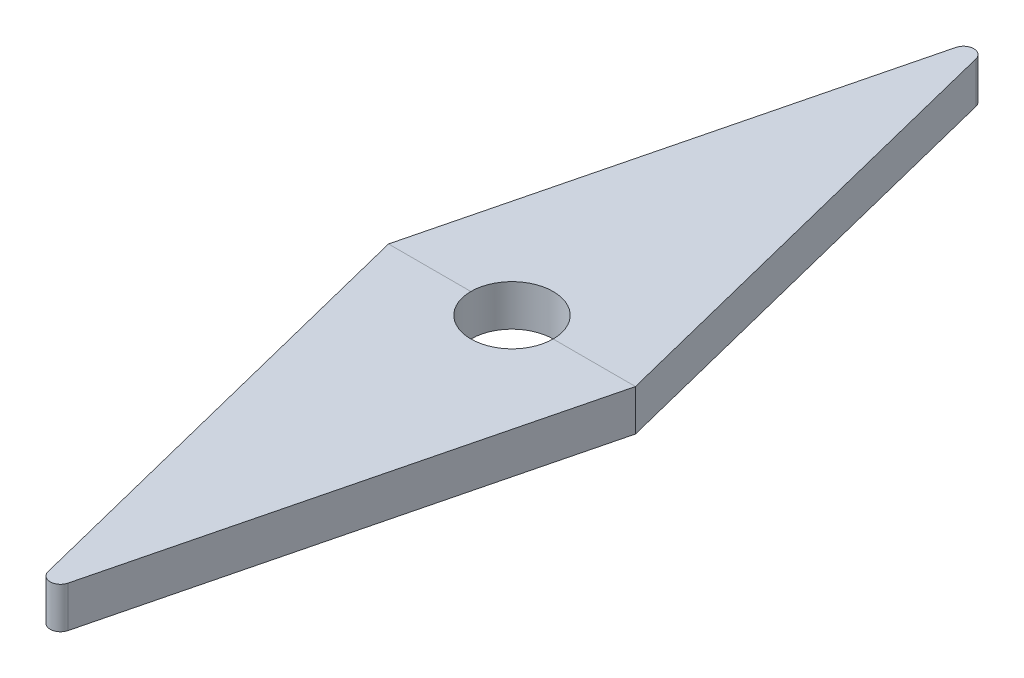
ISO-10303-21;
HEADER;
FILE_DESCRIPTION(('STEP AP214'),'2;1');
FILE_NAME('part.step','',(''),(''),'','','');
FILE_SCHEMA(('AUTOMOTIVE_DESIGN { 1 0 10303 214 1 1 1 1 }'));
ENDSEC;
DATA;
#1=APPLICATION_CONTEXT('core data for automotive mechanical design processes');
#2=APPLICATION_PROTOCOL_DEFINITION('international standard','automotive_design',2000,#1);
#3=PRODUCT_CONTEXT('',#1,'mechanical');
#4=PRODUCT('Part','Part','',(#3));
#5=PRODUCT_RELATED_PRODUCT_CATEGORY('part','',(#4));
#6=PRODUCT_DEFINITION_FORMATION('','',#4);
#7=PRODUCT_DEFINITION_CONTEXT('part definition',#1,'design');
#8=PRODUCT_DEFINITION('design','',#6,#7);
#9=PRODUCT_DEFINITION_SHAPE('','',#8);
#10=(LENGTH_UNIT() NAMED_UNIT(*) SI_UNIT(.MILLI.,.METRE.));
#11=(NAMED_UNIT(*) PLANE_ANGLE_UNIT() SI_UNIT($,.RADIAN.));
#12=(NAMED_UNIT(*) SI_UNIT($,.STERADIAN.) SOLID_ANGLE_UNIT());
#13=UNCERTAINTY_MEASURE_WITH_UNIT(LENGTH_MEASURE(1.E-05),#10,'distance_accuracy_value','');
#14=(GEOMETRIC_REPRESENTATION_CONTEXT(3) GLOBAL_UNCERTAINTY_ASSIGNED_CONTEXT((#13)) GLOBAL_UNIT_ASSIGNED_CONTEXT((#10,
#11,#12)) REPRESENTATION_CONTEXT('',''));
#15=CARTESIAN_POINT('',(0.,0.,0.));
#16=DIRECTION('',(0.,0.,1.));
#17=DIRECTION('',(1.,0.,0.));
#18=AXIS2_PLACEMENT_3D('',#15,#16,#17);
#19=CARTESIAN_POINT('',(0.,6.,0.));
#20=DIRECTION('',(0.,1.,0.));
#21=DIRECTION('',(0.,0.,1.));
#22=AXIS2_PLACEMENT_3D('',#19,#20,#21);
#23=PLANE('',#22);
#24=DIRECTION('',(0.242535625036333,0.,-0.970142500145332));
#25=VECTOR('',#24,1.);
#26=CARTESIAN_POINT('',(0.,6.,24.));
#27=LINE('',#26,#25);
#28=CARTESIAN_POINT('',(0.485071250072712,6.,22.0597149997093));
#29=VERTEX_POINT('',#28);
#30=CARTESIAN_POINT('',(6.00000000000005,6.,0.));
#31=VERTEX_POINT('',#30);
#32=EDGE_CURVE('E125',#29,#31,#27,.T.);
#33=ORIENTED_EDGE('',*,*,#32,.T.);
#34=DIRECTION('',(-1.,0.,0.));
#35=VECTOR('',#34,1.);
#36=CARTESIAN_POINT('',(0.,6.,0.));
#37=LINE('',#36,#35);
#38=CARTESIAN_POINT('',(2.,6.,0.));
#39=VERTEX_POINT('',#38);
#40=EDGE_CURVE('E11',#31,#39,#37,.T.);
#41=ORIENTED_EDGE('',*,*,#40,.T.);
#42=CARTESIAN_POINT('',(0.,6.,0.));
#43=DIRECTION('',(0.,1.,0.));
#44=DIRECTION('',(0.,0.,1.));
#45=AXIS2_PLACEMENT_3D('',#42,#43,#44);
#46=CIRCLE('',#45,2.);
#47=CARTESIAN_POINT('',(-2.,6.,0.));
#48=VERTEX_POINT('',#47);
#49=EDGE_CURVE('E96',#48,#39,#46,.T.);
#50=ORIENTED_EDGE('',*,*,#49,.F.);
#51=CARTESIAN_POINT('',(-5.99999999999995,6.,0.));
#52=VERTEX_POINT('',#51);
#53=EDGE_CURVE('E41',#48,#52,#37,.T.);
#54=ORIENTED_EDGE('',*,*,#53,.T.);
#55=DIRECTION('',(0.242535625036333,0.,0.970142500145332));
#56=VECTOR('',#55,1.);
#57=CARTESIAN_POINT('',(-5.99999999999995,6.,0.));
#58=LINE('',#57,#56);
#59=CARTESIAN_POINT('',(-0.485071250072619,6.,22.0597149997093));
#60=VERTEX_POINT('',#59);
#61=EDGE_CURVE('E94',#52,#60,#58,.T.);
#62=ORIENTED_EDGE('',*,*,#61,.T.);
#63=CARTESIAN_POINT('',(0.,6.,21.9384471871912));
#64=DIRECTION('',(0.,1.,0.));
#65=DIRECTION('',(0.,0.,1.));
#66=AXIS2_PLACEMENT_3D('',#63,#64,#65);
#67=CIRCLE('',#66,0.5);
#68=EDGE_CURVE('E148',#60,#29,#67,.T.);
#69=ORIENTED_EDGE('',*,*,#68,.T.);
#70=EDGE_LOOP('',(#33,#41,#50,#54,#62,#69));
#71=FACE_BOUND('',#70,.T.);
#72=ADVANCED_FACE('F37',(#71),#23,.T.);
#73=ORIENTED_EDGE('',*,*,#40,.F.);
#74=DIRECTION('',(-0.242535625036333,0.,-0.970142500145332));
#75=VECTOR('',#74,1.);
#76=CARTESIAN_POINT('',(6.00000000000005,6.,0.));
#77=LINE('',#76,#75);
#78=CARTESIAN_POINT('',(0.485071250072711,6.,-22.0597149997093));
#79=VERTEX_POINT('',#78);
#80=EDGE_CURVE('E110',#31,#79,#77,.T.);
#81=ORIENTED_EDGE('',*,*,#80,.T.);
#82=CARTESIAN_POINT('',(0.,6.,-21.9384471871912));
#83=DIRECTION('',(0.,1.,0.));
#84=DIRECTION('',(0.,0.,1.));
#85=AXIS2_PLACEMENT_3D('',#82,#83,#84);
#86=CIRCLE('',#85,0.5);
#87=CARTESIAN_POINT('',(-0.485071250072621,6.,-22.0597149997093));
#88=VERTEX_POINT('',#87);
#89=EDGE_CURVE('E106',#79,#88,#86,.T.);
#90=ORIENTED_EDGE('',*,*,#89,.T.);
#91=DIRECTION('',(-0.242535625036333,0.,0.970142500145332));
#92=VECTOR('',#91,1.);
#93=CARTESIAN_POINT('',(0.,6.,-24.));
#94=LINE('',#93,#92);
#95=EDGE_CURVE('E101',#88,#52,#94,.T.);
#96=ORIENTED_EDGE('',*,*,#95,.T.);
#97=ORIENTED_EDGE('',*,*,#53,.F.);
#98=EDGE_CURVE('E133',#39,#48,#46,.T.);
#99=ORIENTED_EDGE('',*,*,#98,.F.);
#100=EDGE_LOOP('',(#73,#81,#90,#96,#97,#99));
#101=FACE_BOUND('',#100,.T.);
#102=ADVANCED_FACE('F103',(#101),#23,.T.);
#103=CARTESIAN_POINT('',(0.,4.,0.));
#104=DIRECTION('',(0.,1.,0.));
#105=DIRECTION('',(0.,0.,1.));
#106=AXIS2_PLACEMENT_3D('',#103,#104,#105);
#107=PLANE('',#106);
#108=DIRECTION('',(-0.242535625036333,0.,0.970142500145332));
#109=VECTOR('',#108,1.);
#110=CARTESIAN_POINT('',(0.,4.,-24.));
#111=LINE('',#110,#109);
#112=CARTESIAN_POINT('',(-0.485071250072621,4.,-22.0597149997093));
#113=VERTEX_POINT('',#112);
#114=CARTESIAN_POINT('',(-5.99999999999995,4.,0.));
#115=VERTEX_POINT('',#114);
#116=EDGE_CURVE('E116',#113,#115,#111,.T.);
#117=ORIENTED_EDGE('',*,*,#116,.F.);
#118=CARTESIAN_POINT('',(0.,4.,-21.9384471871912));
#119=DIRECTION('',(0.,1.,0.));
#120=DIRECTION('',(0.,0.,1.));
#121=AXIS2_PLACEMENT_3D('',#118,#119,#120);
#122=CIRCLE('',#121,0.5);
#123=CARTESIAN_POINT('',(0.485071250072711,4.,-22.0597149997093));
#124=VERTEX_POINT('',#123);
#125=EDGE_CURVE('E144',#113,#124,#122,.F.);
#126=ORIENTED_EDGE('',*,*,#125,.T.);
#127=DIRECTION('',(-0.242535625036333,0.,-0.970142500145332));
#128=VECTOR('',#127,1.);
#129=CARTESIAN_POINT('',(6.00000000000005,4.,0.));
#130=LINE('',#129,#128);
#131=CARTESIAN_POINT('',(6.00000000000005,4.,0.));
#132=VERTEX_POINT('',#131);
#133=EDGE_CURVE('E130',#132,#124,#130,.T.);
#134=ORIENTED_EDGE('',*,*,#133,.F.);
#135=DIRECTION('',(0.242535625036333,0.,-0.970142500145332));
#136=VECTOR('',#135,1.);
#137=CARTESIAN_POINT('',(0.,4.,24.));
#138=LINE('',#137,#136);
#139=CARTESIAN_POINT('',(0.485071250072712,4.,22.0597149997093));
#140=VERTEX_POINT('',#139);
#141=EDGE_CURVE('E137',#140,#132,#138,.T.);
#142=ORIENTED_EDGE('',*,*,#141,.F.);
#143=CARTESIAN_POINT('',(0.,4.,21.9384471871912));
#144=DIRECTION('',(0.,1.,0.));
#145=DIRECTION('',(0.,0.,1.));
#146=AXIS2_PLACEMENT_3D('',#143,#144,#145);
#147=CIRCLE('',#146,0.5);
#148=CARTESIAN_POINT('',(-0.485071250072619,4.,22.0597149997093));
#149=VERTEX_POINT('',#148);
#150=EDGE_CURVE('E142',#140,#149,#147,.F.);
#151=ORIENTED_EDGE('',*,*,#150,.T.);
#152=DIRECTION('',(0.242535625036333,0.,0.970142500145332));
#153=VECTOR('',#152,1.);
#154=CARTESIAN_POINT('',(-5.99999999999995,4.,0.));
#155=LINE('',#154,#153);
#156=EDGE_CURVE('E135',#115,#149,#155,.T.);
#157=ORIENTED_EDGE('',*,*,#156,.F.);
#158=EDGE_LOOP('',(#117,#126,#134,#142,#151,#157));
#159=FACE_BOUND('',#158,.T.);
#160=CARTESIAN_POINT('',(0.,4.,0.));
#161=DIRECTION('',(0.,1.,0.));
#162=DIRECTION('',(0.,0.,1.));
#163=AXIS2_PLACEMENT_3D('',#160,#161,#162);
#164=CIRCLE('',#163,2.);
#165=CARTESIAN_POINT('',(0.,4.,2.));
#166=VERTEX_POINT('',#165);
#167=EDGE_CURVE('E171',#166,#166,#164,.T.);
#168=ORIENTED_EDGE('',*,*,#167,.T.);
#169=EDGE_LOOP('',(#168));
#170=FACE_BOUND('',#169,.T.);
#171=ADVANCED_FACE('F162',(#159,#170),#107,.F.);
#172=CARTESIAN_POINT('',(6.00000000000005,6.,0.));
#173=DIRECTION('',(-0.970142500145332,0.,0.242535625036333));
#174=DIRECTION('',(0.242535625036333,0.,0.970142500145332));
#175=AXIS2_PLACEMENT_3D('',#172,#173,#174);
#176=PLANE('',#175);
#177=ORIENTED_EDGE('',*,*,#133,.T.);
#178=DIRECTION('',(0.,-1.,0.));
#179=VECTOR('',#178,1.);
#180=CARTESIAN_POINT('',(0.485071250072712,6.,-22.0597149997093));
#181=LINE('',#180,#179);
#182=EDGE_CURVE('E146',#124,#79,#181,.F.);
#183=ORIENTED_EDGE('',*,*,#182,.T.);
#184=ORIENTED_EDGE('',*,*,#80,.F.);
#185=DIRECTION('',(0.,-1.,0.));
#186=VECTOR('',#185,1.);
#187=CARTESIAN_POINT('',(6.00000000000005,6.,0.));
#188=LINE('',#187,#186);
#189=EDGE_CURVE('E121',#31,#132,#188,.T.);
#190=ORIENTED_EDGE('',*,*,#189,.T.);
#191=EDGE_LOOP('',(#177,#183,#184,#190));
#192=FACE_BOUND('',#191,.T.);
#193=ADVANCED_FACE('F166',(#192),#176,.F.);
#194=CARTESIAN_POINT('',(0.,6.,-24.));
#195=DIRECTION('',(0.970142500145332,0.,0.242535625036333));
#196=DIRECTION('',(0.242535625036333,0.,-0.970142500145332));
#197=AXIS2_PLACEMENT_3D('',#194,#195,#196);
#198=PLANE('',#197);
#199=ORIENTED_EDGE('',*,*,#95,.F.);
#200=DIRECTION('',(0.,-1.,0.));
#201=VECTOR('',#200,1.);
#202=CARTESIAN_POINT('',(-0.485071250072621,6.,-22.0597149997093));
#203=LINE('',#202,#201);
#204=EDGE_CURVE('E120',#88,#113,#203,.T.);
#205=ORIENTED_EDGE('',*,*,#204,.T.);
#206=ORIENTED_EDGE('',*,*,#116,.T.);
#207=DIRECTION('',(0.,-1.,0.));
#208=VECTOR('',#207,1.);
#209=CARTESIAN_POINT('',(-5.99999999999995,6.,0.));
#210=LINE('',#209,#208);
#211=EDGE_CURVE('E113',#52,#115,#210,.T.);
#212=ORIENTED_EDGE('',*,*,#211,.F.);
#213=EDGE_LOOP('',(#199,#205,#206,#212));
#214=FACE_BOUND('',#213,.T.);
#215=ADVANCED_FACE('F114',(#214),#198,.F.);
#216=CARTESIAN_POINT('',(-5.99999999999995,6.,0.));
#217=DIRECTION('',(0.970142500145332,0.,-0.242535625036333));
#218=DIRECTION('',(-0.242535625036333,0.,-0.970142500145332));
#219=AXIS2_PLACEMENT_3D('',#216,#217,#218);
#220=PLANE('',#219);
#221=ORIENTED_EDGE('',*,*,#156,.T.);
#222=DIRECTION('',(0.,-1.,0.));
#223=VECTOR('',#222,1.);
#224=CARTESIAN_POINT('',(-0.485071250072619,6.,22.0597149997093));
#225=LINE('',#224,#223);
#226=EDGE_CURVE('E99',#149,#60,#225,.F.);
#227=ORIENTED_EDGE('',*,*,#226,.T.);
#228=ORIENTED_EDGE('',*,*,#61,.F.);
#229=ORIENTED_EDGE('',*,*,#211,.T.);
#230=EDGE_LOOP('',(#221,#227,#228,#229));
#231=FACE_BOUND('',#230,.T.);
#232=ADVANCED_FACE('F123',(#231),#220,.F.);
#233=CARTESIAN_POINT('',(0.,6.,24.));
#234=DIRECTION('',(-0.970142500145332,0.,-0.242535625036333));
#235=DIRECTION('',(-0.242535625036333,0.,0.970142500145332));
#236=AXIS2_PLACEMENT_3D('',#233,#234,#235);
#237=PLANE('',#236);
#238=ORIENTED_EDGE('',*,*,#32,.F.);
#239=DIRECTION('',(0.,-1.,0.));
#240=VECTOR('',#239,1.);
#241=CARTESIAN_POINT('',(0.485071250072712,6.,22.0597149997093));
#242=LINE('',#241,#240);
#243=EDGE_CURVE('E151',#29,#140,#242,.T.);
#244=ORIENTED_EDGE('',*,*,#243,.T.);
#245=ORIENTED_EDGE('',*,*,#141,.T.);
#246=ORIENTED_EDGE('',*,*,#189,.F.);
#247=EDGE_LOOP('',(#238,#244,#245,#246));
#248=FACE_BOUND('',#247,.T.);
#249=ADVANCED_FACE('F157',(#248),#237,.F.);
#250=CARTESIAN_POINT('',(0.,6.,0.));
#251=DIRECTION('',(0.,-1.,0.));
#252=DIRECTION('',(0.,0.,-1.));
#253=AXIS2_PLACEMENT_3D('',#250,#251,#252);
#254=CYLINDRICAL_SURFACE('',#253,2.);
#255=ORIENTED_EDGE('',*,*,#98,.T.);
#256=ORIENTED_EDGE('',*,*,#49,.T.);
#257=EDGE_LOOP('',(#255,#256));
#258=FACE_BOUND('',#257,.T.);
#259=ORIENTED_EDGE('',*,*,#167,.F.);
#260=EDGE_LOOP('',(#259));
#261=FACE_BOUND('',#260,.T.);
#262=ADVANCED_FACE('F175',(#258,#261),#254,.F.);
#263=CARTESIAN_POINT('',(0.,6.,-21.9384471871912));
#264=DIRECTION('',(0.,-1.,0.));
#265=DIRECTION('',(0.,0.,-1.));
#266=AXIS2_PLACEMENT_3D('',#263,#264,#265);
#267=CYLINDRICAL_SURFACE('',#266,0.5);
#268=ORIENTED_EDGE('',*,*,#89,.F.);
#269=ORIENTED_EDGE('',*,*,#182,.F.);
#270=ORIENTED_EDGE('',*,*,#125,.F.);
#271=ORIENTED_EDGE('',*,*,#204,.F.);
#272=EDGE_LOOP('',(#268,#269,#270,#271));
#273=FACE_BOUND('',#272,.T.);
#274=ADVANCED_FACE('F169',(#273),#267,.T.);
#275=CARTESIAN_POINT('',(0.,6.,21.9384471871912));
#276=DIRECTION('',(0.,-1.,0.));
#277=DIRECTION('',(0.,0.,-1.));
#278=AXIS2_PLACEMENT_3D('',#275,#276,#277);
#279=CYLINDRICAL_SURFACE('',#278,0.5);
#280=ORIENTED_EDGE('',*,*,#68,.F.);
#281=ORIENTED_EDGE('',*,*,#226,.F.);
#282=ORIENTED_EDGE('',*,*,#150,.F.);
#283=ORIENTED_EDGE('',*,*,#243,.F.);
#284=EDGE_LOOP('',(#280,#281,#282,#283));
#285=FACE_BOUND('',#284,.T.);
#286=ADVANCED_FACE('F39',(#285),#279,.T.);
#287=CLOSED_SHELL('',(#72,#102,#171,#193,#215,#232,#249,#262,#274,#286));
#288=MANIFOLD_SOLID_BREP('B2',#287);
#289=ADVANCED_BREP_SHAPE_REPRESENTATION('',(#18,#288),#14);
#290=SHAPE_DEFINITION_REPRESENTATION(#9,#289);
ENDSEC;
END-ISO-10303-21;
